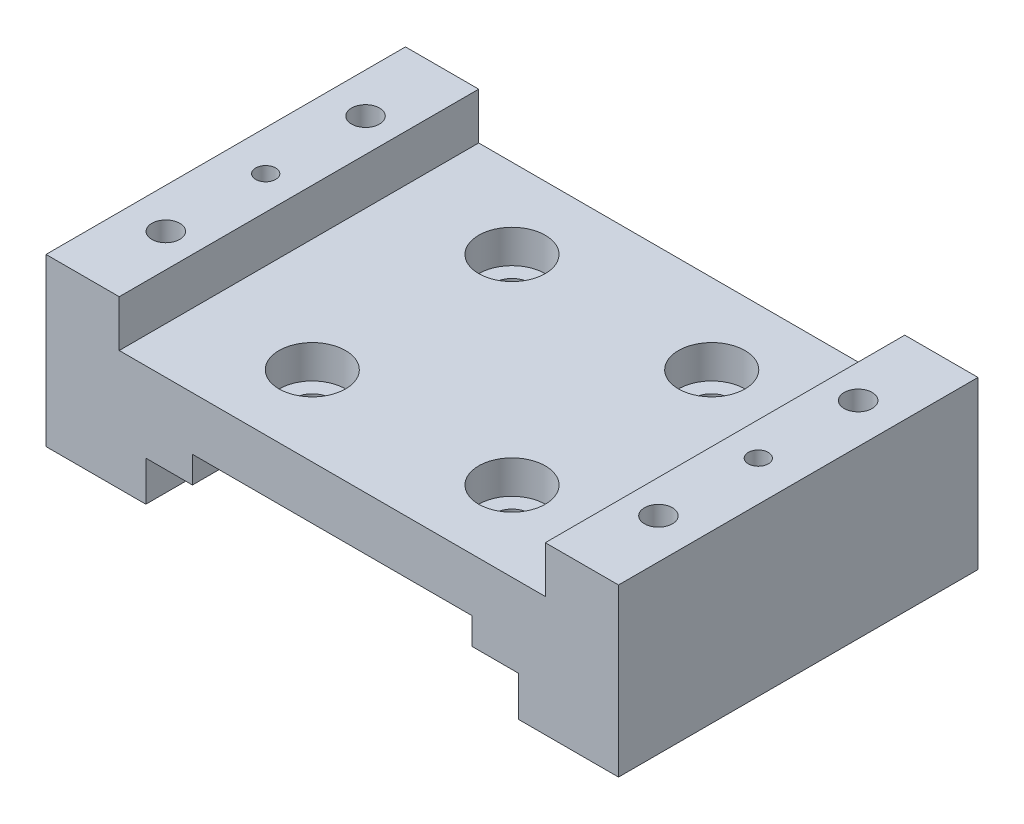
from build123d import *

# Parameters (mm, degrees)
EXTRUDE1_DEPTH                 = 54
M5X0_8_TAPPED_HOLE1_D          = 4.2
M5X0_8_TAPPED_HOLE1_DEPTH      = 12
M5X0_8_TAPPED_HOLE1_TIP        = 1.2618073
CBORE_FOR_M5_SHCS1_D           = 5.3
CBORE_FOR_M5_SHCS1_CBORE_D     = 10
CBORE_FOR_M5_SHCS1_CBORE_DEPTH = 5
M2_5X0_45_TAPPED_HOLE2_D       = 2.05
M2_5X0_45_TAPPED_HOLE2_DEPTH   = 7.25
M2_5X0_45_TAPPED_HOLE2_TIP     = 0.615882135
SKETCH10_R                     = 1.5
CUT_EXTRUDE1_DEPTH             = 3.3


with BuildPart() as part:
    # Sketch1 → Extrude1 (new body)
    with BuildSketch(Plane.XY):
        Polygon((-21, 0), (21, 0), (21, -4), (28, -4), (28, -10), (43, -10), (43, 15), (32, 15), (32, 8), (-32, 8), (-32, 15), (-43, 15), (-43, -10), (-28, -10), (-28, -4), (-21, -4), align=None)
    extrude(amount=EXTRUDE1_DEPTH)

    # M5x0.8 Tapped Hole1
    with Locations(Plane(origin=(-37, 15, 12), x_dir=(1, 0, 0), z_dir=(0, 1, 0))):
        with Locations((0, 0), (74, -30), (0, -30), (74, 0)):
            Hole(M5X0_8_TAPPED_HOLE1_D / 2, depth=M5X0_8_TAPPED_HOLE1_DEPTH)
            with Locations((0, 0, -(M5X0_8_TAPPED_HOLE1_DEPTH + M5X0_8_TAPPED_HOLE1_TIP / 2))):  # 118° drill point
                Cone(0, M5X0_8_TAPPED_HOLE1_D / 2, M5X0_8_TAPPED_HOLE1_TIP, mode=Mode.SUBTRACT)

    # CBORE for M5 SHCS1 (through all)
    with Locations(Plane(origin=(-15, 8, 12), x_dir=(1, 0, 0), z_dir=(0, 1, 0))):
        with Locations((0, 0), (30, 0), (30, -30), (0, -30)):
            CounterBoreHole(CBORE_FOR_M5_SHCS1_D / 2, CBORE_FOR_M5_SHCS1_CBORE_D / 2, CBORE_FOR_M5_SHCS1_CBORE_DEPTH)

    # M2.5x0.45 Tapped Hole2
    with Locations(Plane(origin=(-37, -10, 31), x_dir=(-1, 0, 0), z_dir=(0, -1, 0))):
        with Locations((0, 0), (0, 8), (-74, 0), (-74, 8)):
            Hole(M2_5X0_45_TAPPED_HOLE2_D / 2, depth=M2_5X0_45_TAPPED_HOLE2_DEPTH)
            with Locations((0, 0, -(M2_5X0_45_TAPPED_HOLE2_DEPTH + M2_5X0_45_TAPPED_HOLE2_TIP / 2))):  # 118° drill point
                Cone(0, M2_5X0_45_TAPPED_HOLE2_D / 2, M2_5X0_45_TAPPED_HOLE2_TIP, mode=Mode.SUBTRACT)

    # Sketch10 → Cut-Extrude1 (cut)
    with BuildSketch(Plane(origin=(0, 15, 0), x_dir=(1, 0, 0), z_dir=(0, 1, 0))):
        with Locations(Location((-37, -27, 0), (0, 0, 180))):
            Circle(SKETCH10_R)
        with Locations(Location((37, -27, 0), (0, 0, 180))):
            Circle(SKETCH10_R)
    extrude(amount=-CUT_EXTRUDE1_DEPTH, mode=Mode.SUBTRACT)


solid = part.part
